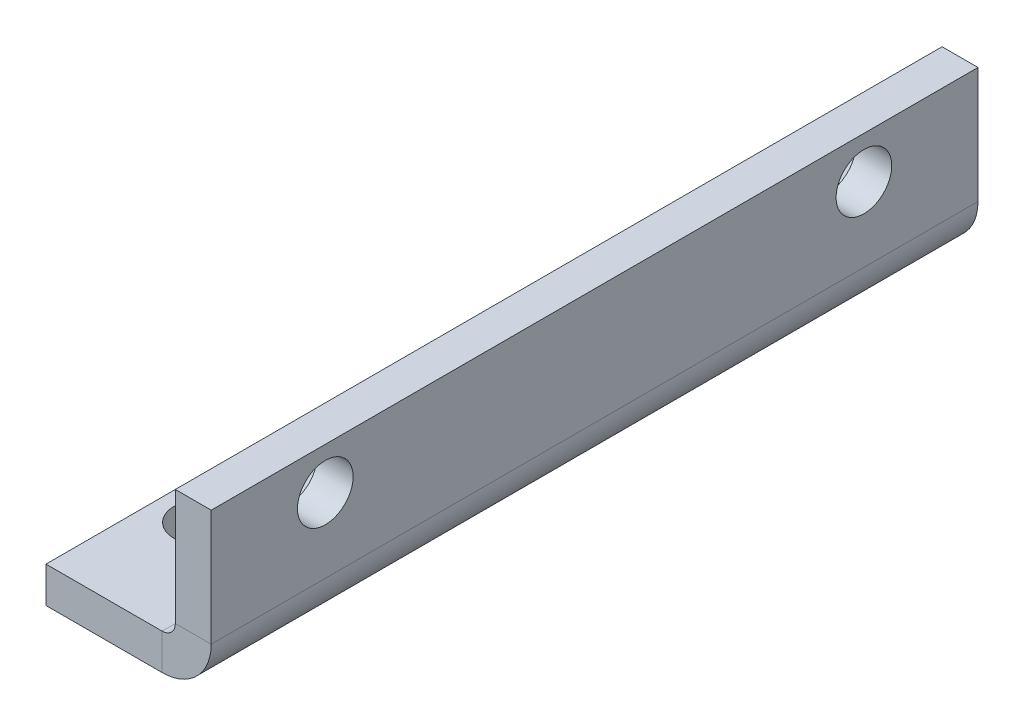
ISO-10303-21;
HEADER;
FILE_DESCRIPTION(('STEP AP214'),'2;1');
FILE_NAME('part.step','',(''),(''),'','','');
FILE_SCHEMA(('AUTOMOTIVE_DESIGN { 1 0 10303 214 1 1 1 1 }'));
ENDSEC;
DATA;
#1=APPLICATION_CONTEXT('core data for automotive mechanical design processes');
#2=APPLICATION_PROTOCOL_DEFINITION('international standard','automotive_design',2000,#1);
#3=PRODUCT_CONTEXT('',#1,'mechanical');
#4=PRODUCT('Part','Part','',(#3));
#5=PRODUCT_RELATED_PRODUCT_CATEGORY('part','',(#4));
#6=PRODUCT_DEFINITION_FORMATION('','',#4);
#7=PRODUCT_DEFINITION_CONTEXT('part definition',#1,'design');
#8=PRODUCT_DEFINITION('design','',#6,#7);
#9=PRODUCT_DEFINITION_SHAPE('','',#8);
#10=(LENGTH_UNIT() NAMED_UNIT(*) SI_UNIT(.MILLI.,.METRE.));
#11=(NAMED_UNIT(*) PLANE_ANGLE_UNIT() SI_UNIT($,.RADIAN.));
#12=(NAMED_UNIT(*) SI_UNIT($,.STERADIAN.) SOLID_ANGLE_UNIT());
#13=UNCERTAINTY_MEASURE_WITH_UNIT(LENGTH_MEASURE(1.E-05),#10,'distance_accuracy_value','');
#14=(GEOMETRIC_REPRESENTATION_CONTEXT(3) GLOBAL_UNCERTAINTY_ASSIGNED_CONTEXT((#13)) GLOBAL_UNIT_ASSIGNED_CONTEXT((#10,
#11,#12)) REPRESENTATION_CONTEXT('',''));
#15=CARTESIAN_POINT('',(0.,0.,0.));
#16=DIRECTION('',(0.,0.,1.));
#17=DIRECTION('',(1.,0.,0.));
#18=AXIS2_PLACEMENT_3D('',#15,#16,#17);
#19=CARTESIAN_POINT('',(-0.627322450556,-0.627322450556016,0.));
#20=DIRECTION('',(1.,0.,0.));
#21=DIRECTION('',(0.,0.,-1.));
#22=AXIS2_PLACEMENT_3D('',#19,#20,#21);
#23=PLANE('',#22);
#24=CARTESIAN_POINT('',(-0.627322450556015,4.87267754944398,-15.));
#25=DIRECTION('',(-1.,0.,0.));
#26=DIRECTION('',(0.,0.,1.));
#27=AXIS2_PLACEMENT_3D('',#24,#25,#26);
#28=CIRCLE('',#27,1.55);
#29=CARTESIAN_POINT('',(-0.627322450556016,4.87267754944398,-13.45));
#30=VERTEX_POINT('',#29);
#31=EDGE_CURVE('E169',#30,#30,#28,.T.);
#32=ORIENTED_EDGE('',*,*,#31,.F.);
#33=EDGE_LOOP('',(#32));
#34=FACE_BOUND('',#33,.T.);
#35=CARTESIAN_POINT('',(-0.627322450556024,4.87267754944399,15.));
#36=DIRECTION('',(-1.,0.,0.));
#37=DIRECTION('',(0.,0.,1.));
#38=AXIS2_PLACEMENT_3D('',#35,#36,#37);
#39=CIRCLE('',#38,1.55);
#40=CARTESIAN_POINT('',(-0.627322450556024,4.87267754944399,16.55));
#41=VERTEX_POINT('',#40);
#42=EDGE_CURVE('E170',#41,#41,#39,.T.);
#43=ORIENTED_EDGE('',*,*,#42,.F.);
#44=EDGE_LOOP('',(#43));
#45=FACE_BOUND('',#44,.T.);
#46=DIRECTION('',(0.,-1.,0.));
#47=VECTOR('',#46,1.);
#48=CARTESIAN_POINT('',(-0.627322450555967,-8.45715090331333,-21.354077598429));
#49=LINE('',#48,#47);
#50=CARTESIAN_POINT('',(-0.627322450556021,7.2025060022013,-21.354077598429));
#51=VERTEX_POINT('',#50);
#52=CARTESIAN_POINT('',(-0.627322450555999,0.73659999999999,-21.354077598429));
#53=VERTEX_POINT('',#52);
#54=EDGE_CURVE('E60',#51,#53,#49,.T.);
#55=ORIENTED_EDGE('',*,*,#54,.T.);
#56=DIRECTION('',(0.,0.,1.));
#57=VECTOR('',#56,1.);
#58=CARTESIAN_POINT('',(-0.627322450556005,0.736599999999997,0.));
#59=LINE('',#58,#57);
#60=CARTESIAN_POINT('',(-0.627322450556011,0.736600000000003,21.354077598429));
#61=VERTEX_POINT('',#60);
#62=EDGE_CURVE('E52',#53,#61,#59,.T.);
#63=ORIENTED_EDGE('',*,*,#62,.T.);
#64=DIRECTION('',(0.,1.,0.));
#65=VECTOR('',#64,1.);
#66=CARTESIAN_POINT('',(-0.627322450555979,-8.45715090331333,21.354077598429));
#67=LINE('',#66,#65);
#68=CARTESIAN_POINT('',(-0.627322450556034,7.2025060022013,21.354077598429));
#69=VERTEX_POINT('',#68);
#70=EDGE_CURVE('E68',#61,#69,#67,.T.);
#71=ORIENTED_EDGE('',*,*,#70,.T.);
#72=DIRECTION('',(0.,0.,-1.));
#73=VECTOR('',#72,1.);
#74=CARTESIAN_POINT('',(-0.627322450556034,7.2025060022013,21.354077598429));
#75=LINE('',#74,#73);
#76=EDGE_CURVE('E177',#69,#51,#75,.T.);
#77=ORIENTED_EDGE('',*,*,#76,.T.);
#78=EDGE_LOOP('',(#55,#63,#71,#77));
#79=FACE_BOUND('',#78,.T.);
#80=ADVANCED_FACE('F43',(#34,#45,#79),#23,.F.);
#81=CARTESIAN_POINT('',(1.37267754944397,7.20250600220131,21.354077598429));
#82=DIRECTION('',(0.,1.,0.));
#83=DIRECTION('',(0.,0.,-1.));
#84=AXIS2_PLACEMENT_3D('',#81,#82,#83);
#85=PLANE('',#84);
#86=ORIENTED_EDGE('',*,*,#76,.F.);
#87=DIRECTION('',(-1.,0.,0.));
#88=VECTOR('',#87,1.);
#89=CARTESIAN_POINT('',(1.37267754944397,7.20250600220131,21.354077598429));
#90=LINE('',#89,#88);
#91=CARTESIAN_POINT('',(1.37267754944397,7.20250600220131,21.354077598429));
#92=VERTEX_POINT('',#91);
#93=EDGE_CURVE('E185',#92,#69,#90,.T.);
#94=ORIENTED_EDGE('',*,*,#93,.F.);
#95=DIRECTION('',(0.,0.,-1.));
#96=VECTOR('',#95,1.);
#97=CARTESIAN_POINT('',(1.37267754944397,7.20250600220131,21.354077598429));
#98=LINE('',#97,#96);
#99=CARTESIAN_POINT('',(1.37267754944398,7.20250600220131,-21.354077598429));
#100=VERTEX_POINT('',#99);
#101=EDGE_CURVE('E180',#92,#100,#98,.T.);
#102=ORIENTED_EDGE('',*,*,#101,.T.);
#103=DIRECTION('',(-1.,0.,0.));
#104=VECTOR('',#103,1.);
#105=CARTESIAN_POINT('',(1.37267754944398,7.20250600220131,-21.354077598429));
#106=LINE('',#105,#104);
#107=EDGE_CURVE('E187',#100,#51,#106,.T.);
#108=ORIENTED_EDGE('',*,*,#107,.T.);
#109=EDGE_LOOP('',(#86,#94,#102,#108));
#110=FACE_BOUND('',#109,.T.);
#111=ADVANCED_FACE('F202',(#110),#85,.T.);
#112=CARTESIAN_POINT('',(1.37267754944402,-8.45715090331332,21.354077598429));
#113=DIRECTION('',(0.,0.,1.));
#114=DIRECTION('',(0.,1.,0.));
#115=AXIS2_PLACEMENT_3D('',#112,#113,#114);
#116=PLANE('',#115);
#117=DIRECTION('',(-1.,0.,0.));
#118=VECTOR('',#117,1.);
#119=CARTESIAN_POINT('',(1.37267754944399,0.736600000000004,21.354077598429));
#120=LINE('',#119,#118);
#121=CARTESIAN_POINT('',(1.37267754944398,0.73660000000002,21.354077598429));
#122=VERTEX_POINT('',#121);
#123=EDGE_CURVE('E190',#122,#61,#120,.T.);
#124=ORIENTED_EDGE('',*,*,#123,.F.);
#125=DIRECTION('',(0.,1.,0.));
#126=VECTOR('',#125,1.);
#127=CARTESIAN_POINT('',(1.37267754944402,-8.45715090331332,21.354077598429));
#128=LINE('',#127,#126);
#129=EDGE_CURVE('E47',#122,#92,#128,.T.);
#130=ORIENTED_EDGE('',*,*,#129,.T.);
#131=ORIENTED_EDGE('',*,*,#93,.T.);
#132=ORIENTED_EDGE('',*,*,#70,.F.);
#133=EDGE_LOOP('',(#124,#130,#131,#132));
#134=FACE_BOUND('',#133,.T.);
#135=ADVANCED_FACE('F198',(#134),#116,.T.);
#136=CARTESIAN_POINT('',(1.37267754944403,-8.45715090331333,-21.354077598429));
#137=DIRECTION('',(0.,0.,-1.));
#138=DIRECTION('',(0.,-1.,0.));
#139=AXIS2_PLACEMENT_3D('',#136,#137,#138);
#140=PLANE('',#139);
#141=DIRECTION('',(1.,0.,0.));
#142=VECTOR('',#141,1.);
#143=CARTESIAN_POINT('',(1.372677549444,0.736600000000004,-21.354077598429));
#144=LINE('',#143,#142);
#145=CARTESIAN_POINT('',(1.372677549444,0.736599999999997,-21.354077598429));
#146=VERTEX_POINT('',#145);
#147=EDGE_CURVE('E12',#53,#146,#144,.T.);
#148=ORIENTED_EDGE('',*,*,#147,.F.);
#149=ORIENTED_EDGE('',*,*,#54,.F.);
#150=ORIENTED_EDGE('',*,*,#107,.F.);
#151=DIRECTION('',(0.,-1.,0.));
#152=VECTOR('',#151,1.);
#153=CARTESIAN_POINT('',(1.37267754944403,-8.45715090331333,-21.354077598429));
#154=LINE('',#153,#152);
#155=EDGE_CURVE('E183',#100,#146,#154,.T.);
#156=ORIENTED_EDGE('',*,*,#155,.T.);
#157=EDGE_LOOP('',(#148,#149,#150,#156));
#158=FACE_BOUND('',#157,.T.);
#159=ADVANCED_FACE('F45',(#158),#140,.T.);
#160=CARTESIAN_POINT('',(1.372677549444,-0.627322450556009,0.));
#161=DIRECTION('',(1.,0.,0.));
#162=DIRECTION('',(0.,0.,-1.));
#163=AXIS2_PLACEMENT_3D('',#160,#161,#162);
#164=PLANE('',#163);
#165=DIRECTION('',(0.,0.,1.));
#166=VECTOR('',#165,1.);
#167=CARTESIAN_POINT('',(1.372677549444,0.736600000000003,0.));
#168=LINE('',#167,#166);
#169=EDGE_CURVE('E132',#146,#122,#168,.T.);
#170=ORIENTED_EDGE('',*,*,#169,.F.);
#171=ORIENTED_EDGE('',*,*,#155,.F.);
#172=ORIENTED_EDGE('',*,*,#101,.F.);
#173=ORIENTED_EDGE('',*,*,#129,.F.);
#174=EDGE_LOOP('',(#170,#171,#172,#173));
#175=FACE_BOUND('',#174,.T.);
#176=CARTESIAN_POINT('',(1.37267754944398,4.87267754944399,15.));
#177=DIRECTION('',(-1.,0.,0.));
#178=DIRECTION('',(0.,0.,1.));
#179=AXIS2_PLACEMENT_3D('',#176,#177,#178);
#180=CIRCLE('',#179,1.55);
#181=CARTESIAN_POINT('',(1.37267754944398,4.87267754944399,16.55));
#182=VERTEX_POINT('',#181);
#183=EDGE_CURVE('E166',#182,#182,#180,.T.);
#184=ORIENTED_EDGE('',*,*,#183,.T.);
#185=EDGE_LOOP('',(#184));
#186=FACE_BOUND('',#185,.T.);
#187=CARTESIAN_POINT('',(1.37267754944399,4.87267754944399,-15.));
#188=DIRECTION('',(-1.,0.,0.));
#189=DIRECTION('',(0.,0.,1.));
#190=AXIS2_PLACEMENT_3D('',#187,#188,#189);
#191=CIRCLE('',#190,1.55);
#192=CARTESIAN_POINT('',(1.37267754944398,4.87267754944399,-13.45));
#193=VERTEX_POINT('',#192);
#194=EDGE_CURVE('E174',#193,#193,#191,.T.);
#195=ORIENTED_EDGE('',*,*,#194,.T.);
#196=EDGE_LOOP('',(#195));
#197=FACE_BOUND('',#196,.T.);
#198=ADVANCED_FACE('F263',(#175,#186,#197),#164,.T.);
#199=CARTESIAN_POINT('',(1.37267754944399,4.87267754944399,-15.));
#200=DIRECTION('',(-1.,0.,0.));
#201=DIRECTION('',(0.,0.,1.));
#202=AXIS2_PLACEMENT_3D('',#199,#200,#201);
#203=CYLINDRICAL_SURFACE('',#202,1.55);
#204=ORIENTED_EDGE('',*,*,#194,.F.);
#205=EDGE_LOOP('',(#204));
#206=FACE_BOUND('',#205,.T.);
#207=ORIENTED_EDGE('',*,*,#31,.T.);
#208=EDGE_LOOP('',(#207));
#209=FACE_BOUND('',#208,.T.);
#210=ADVANCED_FACE('F248',(#206,#209),#203,.F.);
#211=CARTESIAN_POINT('',(1.37267754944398,4.87267754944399,15.));
#212=DIRECTION('',(-1.,0.,0.));
#213=DIRECTION('',(0.,0.,1.));
#214=AXIS2_PLACEMENT_3D('',#211,#212,#213);
#215=CYLINDRICAL_SURFACE('',#214,1.55);
#216=ORIENTED_EDGE('',*,*,#183,.F.);
#217=EDGE_LOOP('',(#216));
#218=FACE_BOUND('',#217,.T.);
#219=ORIENTED_EDGE('',*,*,#42,.T.);
#220=EDGE_LOOP('',(#219));
#221=FACE_BOUND('',#220,.T.);
#222=ADVANCED_FACE('F239',(#218,#221),#215,.F.);
#223=CARTESIAN_POINT('',(-7.82982845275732,-2.,21.354077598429));
#224=DIRECTION('',(-1.,0.,0.));
#225=DIRECTION('',(0.,0.,1.));
#226=AXIS2_PLACEMENT_3D('',#223,#224,#225);
#227=PLANE('',#226);
#228=DIRECTION('',(0.,0.,1.));
#229=VECTOR('',#228,1.);
#230=CARTESIAN_POINT('',(-7.82982845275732,0.,21.354077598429));
#231=LINE('',#230,#229);
#232=CARTESIAN_POINT('',(-7.82982845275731,0.,-21.354077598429));
#233=VERTEX_POINT('',#232);
#234=CARTESIAN_POINT('',(-7.82982845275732,0.,21.354077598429));
#235=VERTEX_POINT('',#234);
#236=EDGE_CURVE('E225',#233,#235,#231,.T.);
#237=ORIENTED_EDGE('',*,*,#236,.F.);
#238=DIRECTION('',(0.,1.,0.));
#239=VECTOR('',#238,1.);
#240=CARTESIAN_POINT('',(-7.82982845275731,-2.,-21.354077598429));
#241=LINE('',#240,#239);
#242=CARTESIAN_POINT('',(-7.82982845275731,-2.,-21.354077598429));
#243=VERTEX_POINT('',#242);
#244=EDGE_CURVE('E173',#243,#233,#241,.T.);
#245=ORIENTED_EDGE('',*,*,#244,.F.);
#246=DIRECTION('',(0.,0.,1.));
#247=VECTOR('',#246,1.);
#248=CARTESIAN_POINT('',(-7.82982845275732,-2.,21.354077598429));
#249=LINE('',#248,#247);
#250=CARTESIAN_POINT('',(-7.82982845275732,-2.,21.354077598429));
#251=VERTEX_POINT('',#250);
#252=EDGE_CURVE('E163',#243,#251,#249,.T.);
#253=ORIENTED_EDGE('',*,*,#252,.T.);
#254=DIRECTION('',(0.,1.,0.));
#255=VECTOR('',#254,1.);
#256=CARTESIAN_POINT('',(-7.82982845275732,-2.,21.354077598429));
#257=LINE('',#256,#255);
#258=EDGE_CURVE('E146',#251,#235,#257,.T.);
#259=ORIENTED_EDGE('',*,*,#258,.T.);
#260=EDGE_LOOP('',(#237,#245,#253,#259));
#261=FACE_BOUND('',#260,.T.);
#262=ADVANCED_FACE('F236',(#261),#227,.T.);
#263=CARTESIAN_POINT('',(-5.5,-2.,15.));
#264=DIRECTION('',(0.,1.,0.));
#265=DIRECTION('',(0.,0.,1.));
#266=AXIS2_PLACEMENT_3D('',#263,#264,#265);
#267=CYLINDRICAL_SURFACE('',#266,1.55);
#268=CARTESIAN_POINT('',(-5.5,-2.,15.));
#269=DIRECTION('',(0.,1.,0.));
#270=DIRECTION('',(0.,0.,1.));
#271=AXIS2_PLACEMENT_3D('',#268,#269,#270);
#272=CIRCLE('',#271,1.55);
#273=CARTESIAN_POINT('',(-5.5,-2.,16.55));
#274=VERTEX_POINT('',#273);
#275=EDGE_CURVE('E143',#274,#274,#272,.T.);
#276=ORIENTED_EDGE('',*,*,#275,.F.);
#277=EDGE_LOOP('',(#276));
#278=FACE_BOUND('',#277,.T.);
#279=CARTESIAN_POINT('',(-5.5,0.,15.));
#280=DIRECTION('',(0.,1.,0.));
#281=DIRECTION('',(0.,0.,1.));
#282=AXIS2_PLACEMENT_3D('',#279,#280,#281);
#283=CIRCLE('',#282,1.55);
#284=CARTESIAN_POINT('',(-5.5,0.,16.55));
#285=VERTEX_POINT('',#284);
#286=EDGE_CURVE('E159',#285,#285,#283,.T.);
#287=ORIENTED_EDGE('',*,*,#286,.T.);
#288=EDGE_LOOP('',(#287));
#289=FACE_BOUND('',#288,.T.);
#290=ADVANCED_FACE('F238',(#278,#289),#267,.F.);
#291=CARTESIAN_POINT('',(-5.5,-2.,-15.));
#292=DIRECTION('',(0.,1.,0.));
#293=DIRECTION('',(0.,0.,1.));
#294=AXIS2_PLACEMENT_3D('',#291,#292,#293);
#295=CYLINDRICAL_SURFACE('',#294,1.55);
#296=CARTESIAN_POINT('',(-5.5,-2.,-15.));
#297=DIRECTION('',(0.,1.,0.));
#298=DIRECTION('',(0.,0.,1.));
#299=AXIS2_PLACEMENT_3D('',#296,#297,#298);
#300=CIRCLE('',#299,1.55);
#301=CARTESIAN_POINT('',(-5.5,-2.,-13.45));
#302=VERTEX_POINT('',#301);
#303=EDGE_CURVE('E153',#302,#302,#300,.T.);
#304=ORIENTED_EDGE('',*,*,#303,.F.);
#305=EDGE_LOOP('',(#304));
#306=FACE_BOUND('',#305,.T.);
#307=CARTESIAN_POINT('',(-5.5,0.,-15.));
#308=DIRECTION('',(0.,1.,0.));
#309=DIRECTION('',(0.,0.,1.));
#310=AXIS2_PLACEMENT_3D('',#307,#308,#309);
#311=CIRCLE('',#310,1.55);
#312=CARTESIAN_POINT('',(-5.5,0.,-13.45));
#313=VERTEX_POINT('',#312);
#314=EDGE_CURVE('E156',#313,#313,#311,.T.);
#315=ORIENTED_EDGE('',*,*,#314,.T.);
#316=EDGE_LOOP('',(#315));
#317=FACE_BOUND('',#316,.T.);
#318=ADVANCED_FACE('F245',(#306,#317),#295,.F.);
#319=CARTESIAN_POINT('',(0.,-2.,0.));
#320=DIRECTION('',(0.,-1.,0.));
#321=DIRECTION('',(0.,0.,-1.));
#322=AXIS2_PLACEMENT_3D('',#319,#320,#321);
#323=PLANE('',#322);
#324=ORIENTED_EDGE('',*,*,#303,.T.);
#325=EDGE_LOOP('',(#324));
#326=FACE_BOUND('',#325,.T.);
#327=ORIENTED_EDGE('',*,*,#275,.T.);
#328=EDGE_LOOP('',(#327));
#329=FACE_BOUND('',#328,.T.);
#330=DIRECTION('',(-1.,0.,0.));
#331=VECTOR('',#330,1.);
#332=CARTESIAN_POINT('',(-7.82982845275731,-2.,-21.354077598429));
#333=LINE('',#332,#331);
#334=CARTESIAN_POINT('',(-1.363922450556,-2.,-21.354077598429));
#335=VERTEX_POINT('',#334);
#336=EDGE_CURVE('E141',#335,#243,#333,.T.);
#337=ORIENTED_EDGE('',*,*,#336,.F.);
#338=DIRECTION('',(0.,0.,1.));
#339=VECTOR('',#338,1.);
#340=CARTESIAN_POINT('',(-1.36392245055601,-2.,0.));
#341=LINE('',#340,#339);
#342=CARTESIAN_POINT('',(-1.36392245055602,-2.,21.354077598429));
#343=VERTEX_POINT('',#342);
#344=EDGE_CURVE('E130',#335,#343,#341,.T.);
#345=ORIENTED_EDGE('',*,*,#344,.T.);
#346=DIRECTION('',(1.,0.,0.));
#347=VECTOR('',#346,1.);
#348=CARTESIAN_POINT('',(-7.82982845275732,-2.,21.354077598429));
#349=LINE('',#348,#347);
#350=EDGE_CURVE('E123',#251,#343,#349,.T.);
#351=ORIENTED_EDGE('',*,*,#350,.F.);
#352=ORIENTED_EDGE('',*,*,#252,.F.);
#353=EDGE_LOOP('',(#337,#345,#351,#352));
#354=FACE_BOUND('',#353,.T.);
#355=ADVANCED_FACE('F139',(#326,#329,#354),#323,.T.);
#356=CARTESIAN_POINT('',(-7.82982845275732,-2.,21.354077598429));
#357=DIRECTION('',(0.,0.,1.));
#358=DIRECTION('',(1.,0.,0.));
#359=AXIS2_PLACEMENT_3D('',#356,#357,#358);
#360=PLANE('',#359);
#361=ORIENTED_EDGE('',*,*,#350,.T.);
#362=DIRECTION('',(0.,1.,0.));
#363=VECTOR('',#362,1.);
#364=CARTESIAN_POINT('',(-1.36392245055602,-2.,21.354077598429));
#365=LINE('',#364,#363);
#366=CARTESIAN_POINT('',(-1.36392245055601,0.,21.354077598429));
#367=VERTEX_POINT('',#366);
#368=EDGE_CURVE('E111',#343,#367,#365,.T.);
#369=ORIENTED_EDGE('',*,*,#368,.T.);
#370=DIRECTION('',(1.,0.,0.));
#371=VECTOR('',#370,1.);
#372=CARTESIAN_POINT('',(-7.82982845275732,0.,21.354077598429));
#373=LINE('',#372,#371);
#374=EDGE_CURVE('E222',#235,#367,#373,.T.);
#375=ORIENTED_EDGE('',*,*,#374,.F.);
#376=ORIENTED_EDGE('',*,*,#258,.F.);
#377=EDGE_LOOP('',(#361,#369,#375,#376));
#378=FACE_BOUND('',#377,.T.);
#379=ADVANCED_FACE('F145',(#378),#360,.T.);
#380=CARTESIAN_POINT('',(0.,0.,0.));
#381=DIRECTION('',(0.,-1.,0.));
#382=DIRECTION('',(0.,0.,-1.));
#383=AXIS2_PLACEMENT_3D('',#380,#381,#382);
#384=PLANE('',#383);
#385=DIRECTION('',(0.,0.,1.));
#386=VECTOR('',#385,1.);
#387=CARTESIAN_POINT('',(-1.36392245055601,0.,0.));
#388=LINE('',#387,#386);
#389=CARTESIAN_POINT('',(-1.36392245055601,0.,-21.354077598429));
#390=VERTEX_POINT('',#389);
#391=EDGE_CURVE('E133',#390,#367,#388,.T.);
#392=ORIENTED_EDGE('',*,*,#391,.F.);
#393=DIRECTION('',(-1.,0.,0.));
#394=VECTOR('',#393,1.);
#395=CARTESIAN_POINT('',(-7.82982845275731,0.,-21.354077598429));
#396=LINE('',#395,#394);
#397=EDGE_CURVE('E122',#390,#233,#396,.T.);
#398=ORIENTED_EDGE('',*,*,#397,.T.);
#399=ORIENTED_EDGE('',*,*,#236,.T.);
#400=ORIENTED_EDGE('',*,*,#374,.T.);
#401=EDGE_LOOP('',(#392,#398,#399,#400));
#402=FACE_BOUND('',#401,.T.);
#403=ORIENTED_EDGE('',*,*,#286,.F.);
#404=EDGE_LOOP('',(#403));
#405=FACE_BOUND('',#404,.T.);
#406=ORIENTED_EDGE('',*,*,#314,.F.);
#407=EDGE_LOOP('',(#406));
#408=FACE_BOUND('',#407,.T.);
#409=ADVANCED_FACE('F229',(#402,#405,#408),#384,.F.);
#410=CARTESIAN_POINT('',(-7.82982845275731,-2.,-21.354077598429));
#411=DIRECTION('',(0.,0.,-1.));
#412=DIRECTION('',(-1.,0.,0.));
#413=AXIS2_PLACEMENT_3D('',#410,#411,#412);
#414=PLANE('',#413);
#415=ORIENTED_EDGE('',*,*,#397,.F.);
#416=DIRECTION('',(0.,-1.,0.));
#417=VECTOR('',#416,1.);
#418=CARTESIAN_POINT('',(-1.363922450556,-2.,-21.354077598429));
#419=LINE('',#418,#417);
#420=EDGE_CURVE('E213',#390,#335,#419,.T.);
#421=ORIENTED_EDGE('',*,*,#420,.T.);
#422=ORIENTED_EDGE('',*,*,#336,.T.);
#423=ORIENTED_EDGE('',*,*,#244,.T.);
#424=EDGE_LOOP('',(#415,#421,#422,#423));
#425=FACE_BOUND('',#424,.T.);
#426=ADVANCED_FACE('F234',(#425),#414,.T.);
#427=CARTESIAN_POINT('',(-1.363922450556,0.7366,-21.354077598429));
#428=DIRECTION('',(0.,0.,-1.));
#429=DIRECTION('',(-1.,0.,0.));
#430=AXIS2_PLACEMENT_3D('',#427,#428,#429);
#431=PLANE('',#430);
#432=ORIENTED_EDGE('',*,*,#420,.F.);
#433=CARTESIAN_POINT('',(-1.363922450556,0.7366,-21.354077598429));
#434=DIRECTION('',(0.,0.,1.));
#435=DIRECTION('',(1.,0.,0.));
#436=AXIS2_PLACEMENT_3D('',#433,#434,#435);
#437=CIRCLE('',#436,0.7366);
#438=EDGE_CURVE('E210',#390,#53,#437,.T.);
#439=ORIENTED_EDGE('',*,*,#438,.T.);
#440=ORIENTED_EDGE('',*,*,#147,.T.);
#441=CARTESIAN_POINT('',(-1.363922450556,0.7366,-21.354077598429));
#442=DIRECTION('',(0.,0.,1.));
#443=DIRECTION('',(-1.,0.,0.));
#444=AXIS2_PLACEMENT_3D('',#441,#442,#443);
#445=CIRCLE('',#444,2.7366);
#446=EDGE_CURVE('E134',#335,#146,#445,.T.);
#447=ORIENTED_EDGE('',*,*,#446,.F.);
#448=EDGE_LOOP('',(#432,#439,#440,#447));
#449=FACE_BOUND('',#448,.T.);
#450=ADVANCED_FACE('F212',(#449),#431,.T.);
#451=CARTESIAN_POINT('',(-1.36392245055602,0.7366,21.354077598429));
#452=DIRECTION('',(0.,0.,1.));
#453=DIRECTION('',(1.,0.,0.));
#454=AXIS2_PLACEMENT_3D('',#451,#452,#453);
#455=PLANE('',#454);
#456=CARTESIAN_POINT('',(-1.36392245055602,0.7366,21.354077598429));
#457=DIRECTION('',(0.,0.,1.));
#458=DIRECTION('',(1.,0.,0.));
#459=AXIS2_PLACEMENT_3D('',#456,#457,#458);
#460=CIRCLE('',#459,0.7366);
#461=EDGE_CURVE('E117',#61,#367,#460,.F.);
#462=ORIENTED_EDGE('',*,*,#461,.T.);
#463=ORIENTED_EDGE('',*,*,#368,.F.);
#464=CARTESIAN_POINT('',(-1.36392245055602,0.7366,21.354077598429));
#465=DIRECTION('',(0.,0.,-1.));
#466=DIRECTION('',(1.,0.,0.));
#467=AXIS2_PLACEMENT_3D('',#464,#465,#466);
#468=CIRCLE('',#467,2.7366);
#469=EDGE_CURVE('E115',#122,#343,#468,.T.);
#470=ORIENTED_EDGE('',*,*,#469,.F.);
#471=ORIENTED_EDGE('',*,*,#123,.T.);
#472=EDGE_LOOP('',(#462,#463,#470,#471));
#473=FACE_BOUND('',#472,.T.);
#474=ADVANCED_FACE('F113',(#473),#455,.T.);
#475=CARTESIAN_POINT('',(-1.363922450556,0.7366,-42.841891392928));
#476=DIRECTION('',(0.,0.,1.));
#477=DIRECTION('',(1.,0.,0.));
#478=AXIS2_PLACEMENT_3D('',#475,#476,#477);
#479=CYLINDRICAL_SURFACE('',#478,2.7366);
#480=ORIENTED_EDGE('',*,*,#169,.T.);
#481=ORIENTED_EDGE('',*,*,#469,.T.);
#482=ORIENTED_EDGE('',*,*,#344,.F.);
#483=ORIENTED_EDGE('',*,*,#446,.T.);
#484=EDGE_LOOP('',(#480,#481,#482,#483));
#485=FACE_BOUND('',#484,.T.);
#486=ADVANCED_FACE('F128',(#485),#479,.T.);
#487=CARTESIAN_POINT('',(-1.363922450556,0.7366,-42.841891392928));
#488=DIRECTION('',(0.,0.,1.));
#489=DIRECTION('',(1.,0.,0.));
#490=AXIS2_PLACEMENT_3D('',#487,#488,#489);
#491=CYLINDRICAL_SURFACE('',#490,0.7366);
#492=ORIENTED_EDGE('',*,*,#62,.F.);
#493=ORIENTED_EDGE('',*,*,#438,.F.);
#494=ORIENTED_EDGE('',*,*,#391,.T.);
#495=ORIENTED_EDGE('',*,*,#461,.F.);
#496=EDGE_LOOP('',(#492,#493,#494,#495));
#497=FACE_BOUND('',#496,.T.);
#498=ADVANCED_FACE('F209',(#497),#491,.F.);
#499=CLOSED_SHELL('',(#80,#111,#135,#159,#198,#210,#222,#262,#290,#318,#355,#379,#409,#426,#450,
#474,#486,#498));
#500=MANIFOLD_SOLID_BREP('B2',#499);
#501=ADVANCED_BREP_SHAPE_REPRESENTATION('',(#18,#500),#14);
#502=SHAPE_DEFINITION_REPRESENTATION(#9,#501);
ENDSEC;
END-ISO-10303-21;
